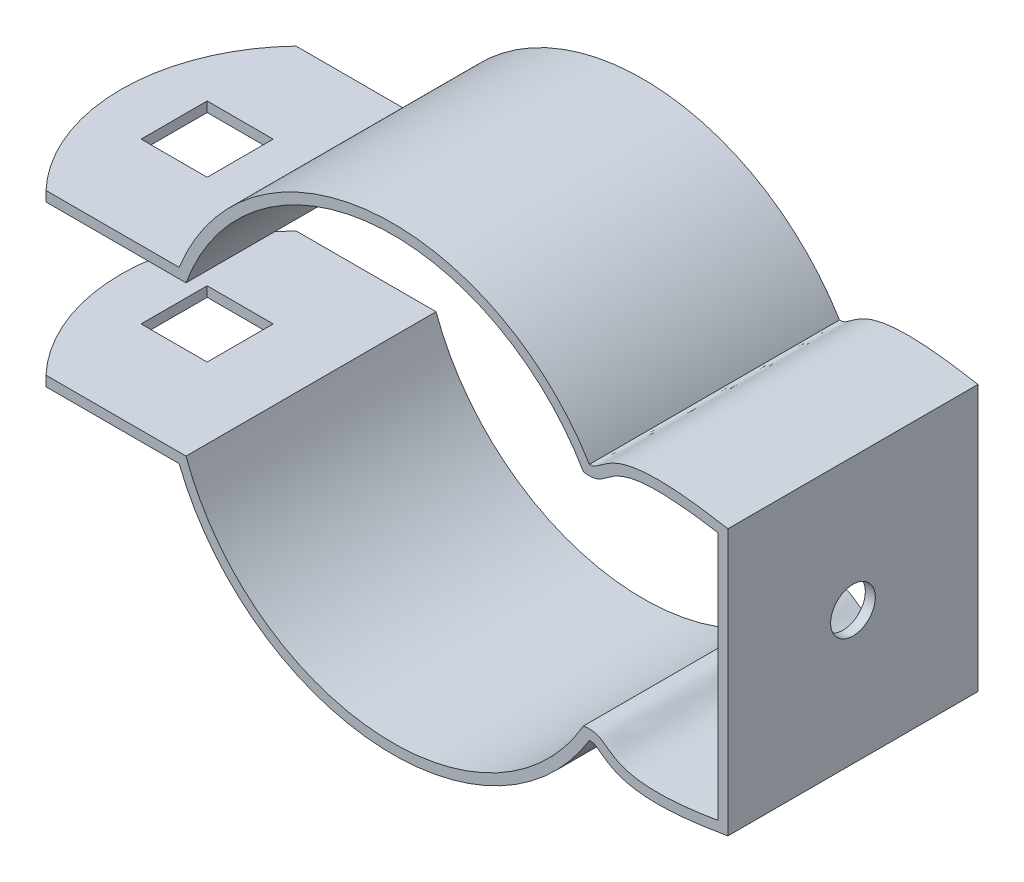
ISO-10303-21;
HEADER;
FILE_DESCRIPTION(('STEP AP214'),'2;1');
FILE_NAME('part.step','',(''),(''),'','','');
FILE_SCHEMA(('AUTOMOTIVE_DESIGN { 1 0 10303 214 1 1 1 1 }'));
ENDSEC;
DATA;
#1=APPLICATION_CONTEXT('core data for automotive mechanical design processes');
#2=APPLICATION_PROTOCOL_DEFINITION('international standard','automotive_design',2000,#1);
#3=PRODUCT_CONTEXT('',#1,'mechanical');
#4=PRODUCT('Part','Part','',(#3));
#5=PRODUCT_RELATED_PRODUCT_CATEGORY('part','',(#4));
#6=PRODUCT_DEFINITION_FORMATION('','',#4);
#7=PRODUCT_DEFINITION_CONTEXT('part definition',#1,'design');
#8=PRODUCT_DEFINITION('design','',#6,#7);
#9=PRODUCT_DEFINITION_SHAPE('','',#8);
#10=(LENGTH_UNIT() NAMED_UNIT(*) SI_UNIT(.MILLI.,.METRE.));
#11=(NAMED_UNIT(*) PLANE_ANGLE_UNIT() SI_UNIT($,.RADIAN.));
#12=(NAMED_UNIT(*) SI_UNIT($,.STERADIAN.) SOLID_ANGLE_UNIT());
#13=UNCERTAINTY_MEASURE_WITH_UNIT(LENGTH_MEASURE(1.E-05),#10,'distance_accuracy_value','');
#14=(GEOMETRIC_REPRESENTATION_CONTEXT(3) GLOBAL_UNCERTAINTY_ASSIGNED_CONTEXT((#13)) GLOBAL_UNIT_ASSIGNED_CONTEXT((#10,
#11,#12)) REPRESENTATION_CONTEXT('',''));
#15=CARTESIAN_POINT('',(0.,0.,0.));
#16=DIRECTION('',(0.,0.,1.));
#17=DIRECTION('',(1.,0.,0.));
#18=AXIS2_PLACEMENT_3D('',#15,#16,#17);
#19=CARTESIAN_POINT('',(-21.5571178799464,17.9950975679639,12.5));
#20=DIRECTION('',(0.,-1.,0.));
#21=DIRECTION('',(0.,0.,-1.));
#22=AXIS2_PLACEMENT_3D('',#19,#20,#21);
#23=CYLINDRICAL_SURFACE('',#22,18.125);
#24=CARTESIAN_POINT('',(-21.5571178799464,7.5,12.5));
#25=DIRECTION('',(0.,1.,0.));
#26=DIRECTION('',(0.,0.,1.));
#27=AXIS2_PLACEMENT_3D('',#24,#25,#26);
#28=CIRCLE('',#27,18.125);
#29=CARTESIAN_POINT('',(-34.6821178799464,7.5,25.));
#30=VERTEX_POINT('',#29);
#31=CARTESIAN_POINT('',(-34.6821178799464,7.49999999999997,0.));
#32=VERTEX_POINT('',#31);
#33=EDGE_CURVE('E267',#30,#32,#28,.F.);
#34=ORIENTED_EDGE('',*,*,#33,.F.);
#35=DIRECTION('',(0.,1.,0.));
#36=VECTOR('',#35,1.);
#37=CARTESIAN_POINT('',(-34.6821178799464,0.,25.));
#38=LINE('',#37,#36);
#39=CARTESIAN_POINT('',(-34.6821178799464,8.5,25.));
#40=VERTEX_POINT('',#39);
#41=EDGE_CURVE('E479',#30,#40,#38,.T.);
#42=ORIENTED_EDGE('',*,*,#41,.T.);
#43=CARTESIAN_POINT('',(-21.5571178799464,8.5,12.5));
#44=DIRECTION('',(0.,-1.,0.));
#45=DIRECTION('',(0.,0.,-1.));
#46=AXIS2_PLACEMENT_3D('',#43,#44,#45);
#47=CIRCLE('',#46,18.125);
#48=CARTESIAN_POINT('',(-34.6821178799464,8.49999999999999,0.));
#49=VERTEX_POINT('',#48);
#50=EDGE_CURVE('E269',#40,#49,#47,.T.);
#51=ORIENTED_EDGE('',*,*,#50,.T.);
#52=DIRECTION('',(0.,1.,0.));
#53=VECTOR('',#52,1.);
#54=CARTESIAN_POINT('',(-34.6821178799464,0.,0.));
#55=LINE('',#54,#53);
#56=EDGE_CURVE('E392',#32,#49,#55,.T.);
#57=ORIENTED_EDGE('',*,*,#56,.F.);
#58=EDGE_LOOP('',(#34,#42,#51,#57));
#59=FACE_BOUND('',#58,.T.);
#60=ADVANCED_FACE('F39',(#59),#23,.T.);
#61=CARTESIAN_POINT('',(33.5,0.,25.));
#62=DIRECTION('',(1.,0.,0.));
#63=DIRECTION('',(0.,0.,-1.));
#64=AXIS2_PLACEMENT_3D('',#61,#62,#63);
#65=PLANE('',#64);
#66=CARTESIAN_POINT('',(33.5,0.,12.5));
#67=DIRECTION('',(1.,0.,0.));
#68=DIRECTION('',(0.,0.,-1.));
#69=AXIS2_PLACEMENT_3D('',#66,#67,#68);
#70=CIRCLE('',#69,2.23393);
#71=CARTESIAN_POINT('',(33.5,0.,10.26607));
#72=VERTEX_POINT('',#71);
#73=EDGE_CURVE('E544',#72,#72,#70,.T.);
#74=ORIENTED_EDGE('',*,*,#73,.F.);
#75=EDGE_LOOP('',(#74));
#76=FACE_BOUND('',#75,.T.);
#77=DIRECTION('',(0.,-1.,0.));
#78=VECTOR('',#77,1.);
#79=CARTESIAN_POINT('',(33.5,0.,0.));
#80=LINE('',#79,#78);
#81=CARTESIAN_POINT('',(33.5,13.2980440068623,0.));
#82=VERTEX_POINT('',#81);
#83=CARTESIAN_POINT('',(33.5,-13.2980440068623,0.));
#84=VERTEX_POINT('',#83);
#85=EDGE_CURVE('E274',#82,#84,#80,.T.);
#86=ORIENTED_EDGE('',*,*,#85,.F.);
#87=DIRECTION('',(0.,0.,-1.));
#88=VECTOR('',#87,1.);
#89=CARTESIAN_POINT('',(33.5,13.2980440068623,25.));
#90=LINE('',#89,#88);
#91=CARTESIAN_POINT('',(33.5,13.2980440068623,25.));
#92=VERTEX_POINT('',#91);
#93=EDGE_CURVE('E11',#92,#82,#90,.T.);
#94=ORIENTED_EDGE('',*,*,#93,.F.);
#95=DIRECTION('',(0.,-1.,0.));
#96=VECTOR('',#95,1.);
#97=CARTESIAN_POINT('',(33.5,0.,25.));
#98=LINE('',#97,#96);
#99=CARTESIAN_POINT('',(33.5,-13.2980440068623,25.));
#100=VERTEX_POINT('',#99);
#101=EDGE_CURVE('E275',#92,#100,#98,.T.);
#102=ORIENTED_EDGE('',*,*,#101,.T.);
#103=DIRECTION('',(0.,0.,-1.));
#104=VECTOR('',#103,1.);
#105=CARTESIAN_POINT('',(33.5,-13.2980440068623,25.));
#106=LINE('',#105,#104);
#107=EDGE_CURVE('E372',#100,#84,#106,.T.);
#108=ORIENTED_EDGE('',*,*,#107,.T.);
#109=EDGE_LOOP('',(#86,#94,#102,#108));
#110=FACE_BOUND('',#109,.T.);
#111=ADVANCED_FACE('F41',(#76,#110),#65,.T.);
#112=CARTESIAN_POINT('',(33.5,13.2980440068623,25.));
#113=CARTESIAN_POINT('',(33.1261043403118,13.3612933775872,25.));
#114=CARTESIAN_POINT('',(32.3695605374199,13.4916630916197,25.));
#115=CARTESIAN_POINT('',(30.9256337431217,13.7163476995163,25.));
#116=CARTESIAN_POINT('',(29.3190618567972,13.9162768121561,25.));
#117=CARTESIAN_POINT('',(27.6553280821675,14.0454168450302,25.));
#118=CARTESIAN_POINT('',(25.7591574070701,14.084635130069,25.));
#119=CARTESIAN_POINT('',(23.9159101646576,13.9155222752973,25.));
#120=CARTESIAN_POINT('',(22.3293240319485,13.4446308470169,25.));
#121=CARTESIAN_POINT('',(21.2309505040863,12.8092823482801,25.));
#122=CARTESIAN_POINT('',(20.6464650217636,12.3460566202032,25.));
#123=CARTESIAN_POINT('',(20.3194048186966,12.125950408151,25.));
#124=CARTESIAN_POINT('',(20.1232766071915,12.0289882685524,25.));
#125=CARTESIAN_POINT('',(19.9476514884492,11.9718309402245,25.));
#126=CARTESIAN_POINT('',(19.7429130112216,11.9521347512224,25.));
#127=CARTESIAN_POINT('',(19.6509426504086,11.9515878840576,25.));
#128=B_SPLINE_CURVE_WITH_KNOTS('',3,(#112,#113,#114,#115,#116,#117,#118,#119,#120,#121,#122,
#123,#124,#125,#126,#127),.UNSPECIFIED.,.F.,.F.,(4,1,1,1,1,1,1,1,1,1,1,1,1,4),
(0.0552082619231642,0.080927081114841,0.106645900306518,0.158083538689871,0.209521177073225,
0.260958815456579,0.363834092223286,0.466709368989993,0.5695846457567,0.672459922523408,
0.723897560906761,0.775335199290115,0.826772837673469,0.878210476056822),.UNSPECIFIED.);
#129=DIRECTION('',(0.,0.,-1.));
#130=VECTOR('',#129,1.);
#131=SURFACE_OF_LINEAR_EXTRUSION('',#128,#130);
#132=CARTESIAN_POINT('',(33.5,13.2980440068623,0.));
#133=CARTESIAN_POINT('',(33.1261043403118,13.3612933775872,0.));
#134=CARTESIAN_POINT('',(32.3695605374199,13.4916630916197,0.));
#135=CARTESIAN_POINT('',(30.9256337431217,13.7163476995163,0.));
#136=CARTESIAN_POINT('',(29.3190618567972,13.9162768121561,0.));
#137=CARTESIAN_POINT('',(27.6553280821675,14.0454168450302,0.));
#138=CARTESIAN_POINT('',(25.7591574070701,14.084635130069,0.));
#139=CARTESIAN_POINT('',(23.9159101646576,13.9155222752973,0.));
#140=CARTESIAN_POINT('',(22.3293240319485,13.4446308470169,0.));
#141=CARTESIAN_POINT('',(21.2309505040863,12.8092823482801,0.));
#142=CARTESIAN_POINT('',(20.6464650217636,12.3460566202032,0.));
#143=CARTESIAN_POINT('',(20.3194048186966,12.125950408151,0.));
#144=CARTESIAN_POINT('',(20.1232766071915,12.0289882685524,0.));
#145=CARTESIAN_POINT('',(19.9476514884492,11.9718309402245,0.));
#146=CARTESIAN_POINT('',(19.7429130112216,11.9521347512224,0.));
#147=CARTESIAN_POINT('',(19.6509426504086,11.9515878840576,0.));
#148=B_SPLINE_CURVE_WITH_KNOTS('',3,(#132,#133,#134,#135,#136,#137,#138,#139,#140,#141,#142,
#143,#144,#145,#146,#147),.UNSPECIFIED.,.F.,.F.,(4,1,1,1,1,1,1,1,1,1,1,1,1,4),
(0.0552082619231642,0.080927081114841,0.106645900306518,0.158083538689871,0.209521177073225,
0.260958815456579,0.363834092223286,0.466709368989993,0.5695846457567,0.672459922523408,
0.723897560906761,0.775335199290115,0.826772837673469,0.878210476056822),.UNSPECIFIED.);
#149=CARTESIAN_POINT('',(19.6509426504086,11.9515878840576,0.));
#150=VERTEX_POINT('',#149);
#151=EDGE_CURVE('E380',#82,#150,#148,.T.);
#152=ORIENTED_EDGE('',*,*,#151,.T.);
#153=DIRECTION('',(0.,0.,-1.));
#154=VECTOR('',#153,1.);
#155=CARTESIAN_POINT('',(19.6509426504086,11.9515878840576,25.));
#156=LINE('',#155,#154);
#157=CARTESIAN_POINT('',(19.6509426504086,11.9515878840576,25.));
#158=VERTEX_POINT('',#157);
#159=EDGE_CURVE('E48',#158,#150,#156,.T.);
#160=ORIENTED_EDGE('',*,*,#159,.F.);
#161=EDGE_CURVE('E278',#92,#158,#128,.T.);
#162=ORIENTED_EDGE('',*,*,#161,.F.);
#163=ORIENTED_EDGE('',*,*,#93,.T.);
#164=EDGE_LOOP('',(#152,#160,#162,#163));
#165=FACE_BOUND('',#164,.T.);
#166=ADVANCED_FACE('F289',(#165),#131,.F.);
#167=CARTESIAN_POINT('',(0.,0.,25.));
#168=DIRECTION('',(0.,0.,-1.));
#169=DIRECTION('',(-1.,0.,0.));
#170=AXIS2_PLACEMENT_3D('',#167,#168,#169);
#171=CYLINDRICAL_SURFACE('',#170,23.);
#172=CARTESIAN_POINT('',(0.,0.,0.));
#173=DIRECTION('',(0.,0.,1.));
#174=DIRECTION('',(1.,0.,0.));
#175=AXIS2_PLACEMENT_3D('',#172,#173,#174);
#176=CIRCLE('',#175,23.);
#177=CARTESIAN_POINT('',(-21.3717102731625,8.49999999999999,0.));
#178=VERTEX_POINT('',#177);
#179=EDGE_CURVE('E384',#150,#178,#176,.T.);
#180=ORIENTED_EDGE('',*,*,#179,.T.);
#181=DIRECTION('',(0.,0.,-1.));
#182=VECTOR('',#181,1.);
#183=CARTESIAN_POINT('',(-21.3717102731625,8.49999999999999,25.));
#184=LINE('',#183,#182);
#185=CARTESIAN_POINT('',(-21.3717102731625,8.49999999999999,25.));
#186=VERTEX_POINT('',#185);
#187=EDGE_CURVE('E458',#186,#178,#184,.T.);
#188=ORIENTED_EDGE('',*,*,#187,.F.);
#189=CARTESIAN_POINT('',(0.,0.,25.));
#190=DIRECTION('',(0.,0.,1.));
#191=DIRECTION('',(1.,0.,0.));
#192=AXIS2_PLACEMENT_3D('',#189,#190,#191);
#193=CIRCLE('',#192,23.);
#194=EDGE_CURVE('E284',#158,#186,#193,.T.);
#195=ORIENTED_EDGE('',*,*,#194,.F.);
#196=ORIENTED_EDGE('',*,*,#159,.T.);
#197=EDGE_LOOP('',(#180,#188,#195,#196));
#198=FACE_BOUND('',#197,.T.);
#199=ADVANCED_FACE('F292',(#198),#171,.T.);
#200=CARTESIAN_POINT('',(0.,8.49999999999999,25.));
#201=DIRECTION('',(0.,-1.,0.));
#202=DIRECTION('',(0.,0.,-1.));
#203=AXIS2_PLACEMENT_3D('',#200,#201,#202);
#204=PLANE('',#203);
#205=DIRECTION('',(-1.,0.,0.));
#206=VECTOR('',#205,1.);
#207=CARTESIAN_POINT('',(0.,8.49999999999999,15.802));
#208=LINE('',#207,#206);
#209=CARTESIAN_POINT('',(-27.7677102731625,8.49999999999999,15.802));
#210=VERTEX_POINT('',#209);
#211=CARTESIAN_POINT('',(-34.3717102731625,8.49999999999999,15.802));
#212=VERTEX_POINT('',#211);
#213=EDGE_CURVE('E254',#210,#212,#208,.T.);
#214=ORIENTED_EDGE('',*,*,#213,.T.);
#215=DIRECTION('',(0.,0.,-1.));
#216=VECTOR('',#215,1.);
#217=CARTESIAN_POINT('',(-34.3717102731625,8.49999999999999,25.));
#218=LINE('',#217,#216);
#219=CARTESIAN_POINT('',(-34.3717102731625,8.49999999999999,9.198));
#220=VERTEX_POINT('',#219);
#221=EDGE_CURVE('E262',#212,#220,#218,.T.);
#222=ORIENTED_EDGE('',*,*,#221,.T.);
#223=DIRECTION('',(1.,0.,0.));
#224=VECTOR('',#223,1.);
#225=CARTESIAN_POINT('',(0.,8.49999999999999,9.198));
#226=LINE('',#225,#224);
#227=CARTESIAN_POINT('',(-27.7677102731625,8.49999999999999,9.198));
#228=VERTEX_POINT('',#227);
#229=EDGE_CURVE('E240',#220,#228,#226,.T.);
#230=ORIENTED_EDGE('',*,*,#229,.T.);
#231=DIRECTION('',(0.,0.,1.));
#232=VECTOR('',#231,1.);
#233=CARTESIAN_POINT('',(-27.7677102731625,8.49999999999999,25.));
#234=LINE('',#233,#232);
#235=EDGE_CURVE('E246',#228,#210,#234,.T.);
#236=ORIENTED_EDGE('',*,*,#235,.T.);
#237=EDGE_LOOP('',(#214,#222,#230,#236));
#238=FACE_BOUND('',#237,.T.);
#239=DIRECTION('',(-1.,0.,0.));
#240=VECTOR('',#239,1.);
#241=CARTESIAN_POINT('',(0.,8.49999999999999,0.));
#242=LINE('',#241,#240);
#243=EDGE_CURVE('E389',#178,#49,#242,.T.);
#244=ORIENTED_EDGE('',*,*,#243,.T.);
#245=ORIENTED_EDGE('',*,*,#50,.F.);
#246=DIRECTION('',(-1.,0.,0.));
#247=VECTOR('',#246,1.);
#248=CARTESIAN_POINT('',(0.,8.49999999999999,25.));
#249=LINE('',#248,#247);
#250=EDGE_CURVE('E476',#186,#40,#249,.T.);
#251=ORIENTED_EDGE('',*,*,#250,.F.);
#252=ORIENTED_EDGE('',*,*,#187,.T.);
#253=EDGE_LOOP('',(#244,#245,#251,#252));
#254=FACE_BOUND('',#253,.T.);
#255=ADVANCED_FACE('F296',(#238,#254),#204,.F.);
#256=CARTESIAN_POINT('',(0.,7.5,25.));
#257=DIRECTION('',(0.,-1.,0.));
#258=DIRECTION('',(1.,0.,0.));
#259=AXIS2_PLACEMENT_3D('',#256,#257,#258);
#260=PLANE('',#259);
#261=DIRECTION('',(0.,0.,-1.));
#262=VECTOR('',#261,1.);
#263=CARTESIAN_POINT('',(-34.3717102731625,7.5,25.));
#264=LINE('',#263,#262);
#265=CARTESIAN_POINT('',(-34.3717102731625,7.5,15.802));
#266=VERTEX_POINT('',#265);
#267=CARTESIAN_POINT('',(-34.3717102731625,7.5,9.198));
#268=VERTEX_POINT('',#267);
#269=EDGE_CURVE('E260',#266,#268,#264,.T.);
#270=ORIENTED_EDGE('',*,*,#269,.F.);
#271=DIRECTION('',(-1.,0.,0.));
#272=VECTOR('',#271,1.);
#273=CARTESIAN_POINT('',(0.,7.5,15.802));
#274=LINE('',#273,#272);
#275=CARTESIAN_POINT('',(-27.7677102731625,7.5,15.802));
#276=VERTEX_POINT('',#275);
#277=EDGE_CURVE('E252',#276,#266,#274,.T.);
#278=ORIENTED_EDGE('',*,*,#277,.F.);
#279=DIRECTION('',(0.,0.,1.));
#280=VECTOR('',#279,1.);
#281=CARTESIAN_POINT('',(-27.7677102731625,7.5,25.));
#282=LINE('',#281,#280);
#283=CARTESIAN_POINT('',(-27.7677102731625,7.5,9.198));
#284=VERTEX_POINT('',#283);
#285=EDGE_CURVE('E244',#284,#276,#282,.T.);
#286=ORIENTED_EDGE('',*,*,#285,.F.);
#287=DIRECTION('',(1.,0.,0.));
#288=VECTOR('',#287,1.);
#289=CARTESIAN_POINT('',(0.,7.5,9.198));
#290=LINE('',#289,#288);
#291=EDGE_CURVE('E238',#268,#284,#290,.T.);
#292=ORIENTED_EDGE('',*,*,#291,.F.);
#293=EDGE_LOOP('',(#270,#278,#286,#292));
#294=FACE_BOUND('',#293,.T.);
#295=DIRECTION('',(-1.,0.,0.));
#296=VECTOR('',#295,1.);
#297=CARTESIAN_POINT('',(0.,7.5,0.));
#298=LINE('',#297,#296);
#299=CARTESIAN_POINT('',(-20.6821178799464,7.5,0.));
#300=VERTEX_POINT('',#299);
#301=EDGE_CURVE('E395',#300,#32,#298,.T.);
#302=ORIENTED_EDGE('',*,*,#301,.F.);
#303=DIRECTION('',(0.,0.,-1.));
#304=VECTOR('',#303,1.);
#305=CARTESIAN_POINT('',(-20.6821178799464,7.5,25.));
#306=LINE('',#305,#304);
#307=CARTESIAN_POINT('',(-20.6821178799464,7.5,25.));
#308=VERTEX_POINT('',#307);
#309=EDGE_CURVE('E456',#308,#300,#306,.T.);
#310=ORIENTED_EDGE('',*,*,#309,.F.);
#311=DIRECTION('',(-1.,0.,0.));
#312=VECTOR('',#311,1.);
#313=CARTESIAN_POINT('',(0.,7.5,25.));
#314=LINE('',#313,#312);
#315=EDGE_CURVE('E480',#308,#30,#314,.T.);
#316=ORIENTED_EDGE('',*,*,#315,.T.);
#317=ORIENTED_EDGE('',*,*,#33,.T.);
#318=EDGE_LOOP('',(#302,#310,#316,#317));
#319=FACE_BOUND('',#318,.T.);
#320=ADVANCED_FACE('F300',(#294,#319),#260,.T.);
#321=CARTESIAN_POINT('',(0.,0.,25.));
#322=DIRECTION('',(0.,0.,-1.));
#323=DIRECTION('',(-1.,0.,0.));
#324=AXIS2_PLACEMENT_3D('',#321,#322,#323);
#325=CYLINDRICAL_SURFACE('',#324,22.);
#326=CARTESIAN_POINT('',(0.,0.,0.));
#327=DIRECTION('',(0.,0.,1.));
#328=DIRECTION('',(1.,0.,0.));
#329=AXIS2_PLACEMENT_3D('',#326,#327,#328);
#330=CIRCLE('',#329,22.);
#331=CARTESIAN_POINT('',(19.0525588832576,11.,0.));
#332=VERTEX_POINT('',#331);
#333=EDGE_CURVE('E398',#332,#300,#330,.T.);
#334=ORIENTED_EDGE('',*,*,#333,.F.);
#335=DIRECTION('',(0.,0.,-1.));
#336=VECTOR('',#335,1.);
#337=CARTESIAN_POINT('',(19.0525588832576,11.,25.));
#338=LINE('',#337,#336);
#339=CARTESIAN_POINT('',(19.0525588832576,11.,25.));
#340=VERTEX_POINT('',#339);
#341=EDGE_CURVE('E454',#340,#332,#338,.T.);
#342=ORIENTED_EDGE('',*,*,#341,.F.);
#343=CARTESIAN_POINT('',(0.,0.,25.));
#344=DIRECTION('',(0.,0.,1.));
#345=DIRECTION('',(1.,0.,0.));
#346=AXIS2_PLACEMENT_3D('',#343,#344,#345);
#347=CIRCLE('',#346,22.);
#348=EDGE_CURVE('E323',#340,#308,#347,.T.);
#349=ORIENTED_EDGE('',*,*,#348,.T.);
#350=ORIENTED_EDGE('',*,*,#309,.T.);
#351=EDGE_LOOP('',(#334,#342,#349,#350));
#352=FACE_BOUND('',#351,.T.);
#353=ADVANCED_FACE('F304',(#352),#325,.F.);
#354=CARTESIAN_POINT('',(19.0525588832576,11.,25.));
#355=CARTESIAN_POINT('',(22.5442841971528,10.4663623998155,25.));
#356=CARTESIAN_POINT('',(20.0291097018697,14.5626151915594,25.));
#357=CARTESIAN_POINT('',(32.5,12.453,25.));
#358=B_SPLINE_CURVE_WITH_KNOTS('',3,(#354,#355,#356,#357),.UNSPECIFIED.,.F.,.F.,(4,4),(0.,
0.859078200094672),.UNSPECIFIED.);
#359=DIRECTION('',(0.,0.,-1.));
#360=VECTOR('',#359,1.);
#361=SURFACE_OF_LINEAR_EXTRUSION('',#358,#360);
#362=CARTESIAN_POINT('',(19.0525588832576,11.,0.));
#363=CARTESIAN_POINT('',(22.5442841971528,10.4663623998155,0.));
#364=CARTESIAN_POINT('',(20.0291097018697,14.5626151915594,0.));
#365=CARTESIAN_POINT('',(32.5,12.453,0.));
#366=B_SPLINE_CURVE_WITH_KNOTS('',3,(#362,#363,#364,#365),.UNSPECIFIED.,.F.,.F.,(4,4),(0.,
0.859078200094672),.UNSPECIFIED.);
#367=CARTESIAN_POINT('',(32.5,12.453,0.));
#368=VERTEX_POINT('',#367);
#369=EDGE_CURVE('E401',#332,#368,#366,.T.);
#370=ORIENTED_EDGE('',*,*,#369,.T.);
#371=DIRECTION('',(0.,0.,-1.));
#372=VECTOR('',#371,1.);
#373=CARTESIAN_POINT('',(32.5,12.453,25.));
#374=LINE('',#373,#372);
#375=CARTESIAN_POINT('',(32.5,12.453,25.));
#376=VERTEX_POINT('',#375);
#377=EDGE_CURVE('E451',#376,#368,#374,.T.);
#378=ORIENTED_EDGE('',*,*,#377,.F.);
#379=EDGE_CURVE('E316',#340,#376,#358,.T.);
#380=ORIENTED_EDGE('',*,*,#379,.F.);
#381=ORIENTED_EDGE('',*,*,#341,.T.);
#382=EDGE_LOOP('',(#370,#378,#380,#381));
#383=FACE_BOUND('',#382,.T.);
#384=ADVANCED_FACE('F308',(#383),#361,.F.);
#385=CARTESIAN_POINT('',(32.5,0.,25.));
#386=DIRECTION('',(1.,0.,0.));
#387=DIRECTION('',(0.,1.,0.));
#388=AXIS2_PLACEMENT_3D('',#385,#386,#387);
#389=PLANE('',#388);
#390=CARTESIAN_POINT('',(32.5,0.,12.5));
#391=DIRECTION('',(1.,0.,0.));
#392=DIRECTION('',(0.,1.,0.));
#393=AXIS2_PLACEMENT_3D('',#390,#391,#392);
#394=CIRCLE('',#393,2.23393);
#395=CARTESIAN_POINT('',(32.5,2.23393,12.5));
#396=VERTEX_POINT('',#395);
#397=EDGE_CURVE('E43',#396,#396,#394,.T.);
#398=ORIENTED_EDGE('',*,*,#397,.T.);
#399=EDGE_LOOP('',(#398));
#400=FACE_BOUND('',#399,.T.);
#401=DIRECTION('',(0.,-1.,0.));
#402=VECTOR('',#401,1.);
#403=CARTESIAN_POINT('',(32.5,0.,0.));
#404=LINE('',#403,#402);
#405=CARTESIAN_POINT('',(32.5,-12.453,0.));
#406=VERTEX_POINT('',#405);
#407=EDGE_CURVE('E405',#368,#406,#404,.T.);
#408=ORIENTED_EDGE('',*,*,#407,.T.);
#409=DIRECTION('',(0.,0.,-1.));
#410=VECTOR('',#409,1.);
#411=CARTESIAN_POINT('',(32.5,-12.453,25.));
#412=LINE('',#411,#410);
#413=CARTESIAN_POINT('',(32.5,-12.453,25.));
#414=VERTEX_POINT('',#413);
#415=EDGE_CURVE('E449',#414,#406,#412,.T.);
#416=ORIENTED_EDGE('',*,*,#415,.F.);
#417=DIRECTION('',(0.,-1.,0.));
#418=VECTOR('',#417,1.);
#419=CARTESIAN_POINT('',(32.5,0.,25.));
#420=LINE('',#419,#418);
#421=EDGE_CURVE('E322',#376,#414,#420,.T.);
#422=ORIENTED_EDGE('',*,*,#421,.F.);
#423=ORIENTED_EDGE('',*,*,#377,.T.);
#424=EDGE_LOOP('',(#408,#416,#422,#423));
#425=FACE_BOUND('',#424,.T.);
#426=ADVANCED_FACE('F313',(#400,#425),#389,.F.);
#427=CARTESIAN_POINT('',(19.0525588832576,-11.,25.));
#428=CARTESIAN_POINT('',(22.5442841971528,-10.4663623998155,25.));
#429=CARTESIAN_POINT('',(20.0291097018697,-14.5626151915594,25.));
#430=CARTESIAN_POINT('',(32.5,-12.453,25.));
#431=B_SPLINE_CURVE_WITH_KNOTS('',3,(#427,#428,#429,#430),.UNSPECIFIED.,.F.,.F.,(4,4),(0.,
0.859078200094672),.UNSPECIFIED.);
#432=DIRECTION('',(0.,0.,-1.));
#433=VECTOR('',#432,1.);
#434=SURFACE_OF_LINEAR_EXTRUSION('',#431,#433);
#435=CARTESIAN_POINT('',(19.0525588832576,-11.,0.));
#436=CARTESIAN_POINT('',(22.5442841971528,-10.4663623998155,0.));
#437=CARTESIAN_POINT('',(20.0291097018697,-14.5626151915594,0.));
#438=CARTESIAN_POINT('',(32.5,-12.453,0.));
#439=B_SPLINE_CURVE_WITH_KNOTS('',3,(#435,#436,#437,#438),.UNSPECIFIED.,.F.,.F.,(4,4),(0.,
0.859078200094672),.UNSPECIFIED.);
#440=CARTESIAN_POINT('',(19.0525588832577,-11.,0.));
#441=VERTEX_POINT('',#440);
#442=EDGE_CURVE('E411',#441,#406,#439,.T.);
#443=ORIENTED_EDGE('',*,*,#442,.F.);
#444=DIRECTION('',(0.,0.,-1.));
#445=VECTOR('',#444,1.);
#446=CARTESIAN_POINT('',(19.0525588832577,-11.,25.));
#447=LINE('',#446,#445);
#448=CARTESIAN_POINT('',(19.0525588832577,-11.,25.));
#449=VERTEX_POINT('',#448);
#450=EDGE_CURVE('E447',#449,#441,#447,.T.);
#451=ORIENTED_EDGE('',*,*,#450,.F.);
#452=EDGE_CURVE('E329',#449,#414,#431,.T.);
#453=ORIENTED_EDGE('',*,*,#452,.T.);
#454=ORIENTED_EDGE('',*,*,#415,.T.);
#455=EDGE_LOOP('',(#443,#451,#453,#454));
#456=FACE_BOUND('',#455,.T.);
#457=ADVANCED_FACE('F340',(#456),#434,.T.);
#458=CARTESIAN_POINT('',(0.,0.,25.));
#459=DIRECTION('',(0.,0.,-1.));
#460=DIRECTION('',(-1.,0.,0.));
#461=AXIS2_PLACEMENT_3D('',#458,#459,#460);
#462=CYLINDRICAL_SURFACE('',#461,22.);
#463=CARTESIAN_POINT('',(0.,0.,0.));
#464=DIRECTION('',(0.,0.,1.));
#465=DIRECTION('',(1.,0.,0.));
#466=AXIS2_PLACEMENT_3D('',#463,#464,#465);
#467=CIRCLE('',#466,22.);
#468=CARTESIAN_POINT('',(-20.6821178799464,-7.5,0.));
#469=VERTEX_POINT('',#468);
#470=EDGE_CURVE('E416',#469,#441,#467,.T.);
#471=ORIENTED_EDGE('',*,*,#470,.F.);
#472=DIRECTION('',(0.,0.,-1.));
#473=VECTOR('',#472,1.);
#474=CARTESIAN_POINT('',(-20.6821178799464,-7.5,25.));
#475=LINE('',#474,#473);
#476=CARTESIAN_POINT('',(-20.6821178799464,-7.5,25.));
#477=VERTEX_POINT('',#476);
#478=EDGE_CURVE('E445',#477,#469,#475,.T.);
#479=ORIENTED_EDGE('',*,*,#478,.F.);
#480=CARTESIAN_POINT('',(0.,0.,25.));
#481=DIRECTION('',(0.,0.,1.));
#482=DIRECTION('',(1.,0.,0.));
#483=AXIS2_PLACEMENT_3D('',#480,#481,#482);
#484=CIRCLE('',#483,22.);
#485=EDGE_CURVE('E335',#477,#449,#484,.T.);
#486=ORIENTED_EDGE('',*,*,#485,.T.);
#487=ORIENTED_EDGE('',*,*,#450,.T.);
#488=EDGE_LOOP('',(#471,#479,#486,#487));
#489=FACE_BOUND('',#488,.T.);
#490=ADVANCED_FACE('F343',(#489),#462,.F.);
#491=CARTESIAN_POINT('',(0.,-7.5,25.));
#492=DIRECTION('',(0.,-1.,0.));
#493=DIRECTION('',(1.,0.,0.));
#494=AXIS2_PLACEMENT_3D('',#491,#492,#493);
#495=PLANE('',#494);
#496=DIRECTION('',(-1.,0.,0.));
#497=VECTOR('',#496,1.);
#498=CARTESIAN_POINT('',(0.,-7.5,15.802));
#499=LINE('',#498,#497);
#500=CARTESIAN_POINT('',(-27.7677102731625,-7.5,15.802));
#501=VERTEX_POINT('',#500);
#502=CARTESIAN_POINT('',(-34.3717102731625,-7.5,15.802));
#503=VERTEX_POINT('',#502);
#504=EDGE_CURVE('E249',#501,#503,#499,.T.);
#505=ORIENTED_EDGE('',*,*,#504,.T.);
#506=DIRECTION('',(0.,0.,-1.));
#507=VECTOR('',#506,1.);
#508=CARTESIAN_POINT('',(-34.3717102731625,-7.5,25.));
#509=LINE('',#508,#507);
#510=CARTESIAN_POINT('',(-34.3717102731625,-7.5,9.198));
#511=VERTEX_POINT('',#510);
#512=EDGE_CURVE('E257',#503,#511,#509,.T.);
#513=ORIENTED_EDGE('',*,*,#512,.T.);
#514=DIRECTION('',(1.,0.,0.));
#515=VECTOR('',#514,1.);
#516=CARTESIAN_POINT('',(0.,-7.5,9.198));
#517=LINE('',#516,#515);
#518=CARTESIAN_POINT('',(-27.7677102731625,-7.5,9.198));
#519=VERTEX_POINT('',#518);
#520=EDGE_CURVE('E236',#511,#519,#517,.T.);
#521=ORIENTED_EDGE('',*,*,#520,.T.);
#522=DIRECTION('',(0.,0.,1.));
#523=VECTOR('',#522,1.);
#524=CARTESIAN_POINT('',(-27.7677102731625,-7.5,25.));
#525=LINE('',#524,#523);
#526=EDGE_CURVE('E207',#519,#501,#525,.T.);
#527=ORIENTED_EDGE('',*,*,#526,.T.);
#528=EDGE_LOOP('',(#505,#513,#521,#527));
#529=FACE_BOUND('',#528,.T.);
#530=DIRECTION('',(-1.,0.,0.));
#531=VECTOR('',#530,1.);
#532=CARTESIAN_POINT('',(0.,-7.5,0.));
#533=LINE('',#532,#531);
#534=CARTESIAN_POINT('',(-34.6821178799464,-7.5,0.));
#535=VERTEX_POINT('',#534);
#536=EDGE_CURVE('E422',#469,#535,#533,.T.);
#537=ORIENTED_EDGE('',*,*,#536,.T.);
#538=CARTESIAN_POINT('',(-21.5571178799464,-7.5,12.5));
#539=DIRECTION('',(0.,-1.,0.));
#540=DIRECTION('',(0.,0.,-1.));
#541=AXIS2_PLACEMENT_3D('',#538,#539,#540);
#542=CIRCLE('',#541,18.125);
#543=CARTESIAN_POINT('',(-34.6821178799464,-7.5,25.));
#544=VERTEX_POINT('',#543);
#545=EDGE_CURVE('E265',#535,#544,#542,.F.);
#546=ORIENTED_EDGE('',*,*,#545,.T.);
#547=DIRECTION('',(-1.,0.,0.));
#548=VECTOR('',#547,1.);
#549=CARTESIAN_POINT('',(0.,-7.5,25.));
#550=LINE('',#549,#548);
#551=EDGE_CURVE('E505',#477,#544,#550,.T.);
#552=ORIENTED_EDGE('',*,*,#551,.F.);
#553=ORIENTED_EDGE('',*,*,#478,.T.);
#554=EDGE_LOOP('',(#537,#546,#552,#553));
#555=FACE_BOUND('',#554,.T.);
#556=ADVANCED_FACE('F347',(#529,#555),#495,.F.);
#557=CARTESIAN_POINT('',(0.,-8.5,25.));
#558=DIRECTION('',(0.,-1.,0.));
#559=DIRECTION('',(0.,0.,-1.));
#560=AXIS2_PLACEMENT_3D('',#557,#558,#559);
#561=PLANE('',#560);
#562=DIRECTION('',(0.,0.,-1.));
#563=VECTOR('',#562,1.);
#564=CARTESIAN_POINT('',(-34.3717102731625,-8.5,15.802));
#565=LINE('',#564,#563);
#566=CARTESIAN_POINT('',(-34.3717102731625,-8.5,15.802));
#567=VERTEX_POINT('',#566);
#568=CARTESIAN_POINT('',(-34.3717102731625,-8.5,9.198));
#569=VERTEX_POINT('',#568);
#570=EDGE_CURVE('E219',#567,#569,#565,.T.);
#571=ORIENTED_EDGE('',*,*,#570,.F.);
#572=DIRECTION('',(-1.,0.,0.));
#573=VECTOR('',#572,1.);
#574=CARTESIAN_POINT('',(-34.3717102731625,-8.5,15.802));
#575=LINE('',#574,#573);
#576=CARTESIAN_POINT('',(-27.7677102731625,-8.5,15.802));
#577=VERTEX_POINT('',#576);
#578=EDGE_CURVE('E224',#577,#567,#575,.T.);
#579=ORIENTED_EDGE('',*,*,#578,.F.);
#580=DIRECTION('',(0.,0.,1.));
#581=VECTOR('',#580,1.);
#582=CARTESIAN_POINT('',(-27.7677102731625,-8.5,15.802));
#583=LINE('',#582,#581);
#584=CARTESIAN_POINT('',(-27.7677102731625,-8.5,9.198));
#585=VERTEX_POINT('',#584);
#586=EDGE_CURVE('E204',#585,#577,#583,.T.);
#587=ORIENTED_EDGE('',*,*,#586,.F.);
#588=DIRECTION('',(1.,0.,0.));
#589=VECTOR('',#588,1.);
#590=CARTESIAN_POINT('',(-34.3717102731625,-8.5,9.198));
#591=LINE('',#590,#589);
#592=EDGE_CURVE('E213',#569,#585,#591,.T.);
#593=ORIENTED_EDGE('',*,*,#592,.F.);
#594=EDGE_LOOP('',(#571,#579,#587,#593));
#595=FACE_BOUND('',#594,.T.);
#596=DIRECTION('',(-1.,0.,0.));
#597=VECTOR('',#596,1.);
#598=CARTESIAN_POINT('',(0.,-8.5,0.));
#599=LINE('',#598,#597);
#600=CARTESIAN_POINT('',(-21.3717102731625,-8.5,0.));
#601=VERTEX_POINT('',#600);
#602=CARTESIAN_POINT('',(-34.6821178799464,-8.5,0.));
#603=VERTEX_POINT('',#602);
#604=EDGE_CURVE('E428',#601,#603,#599,.T.);
#605=ORIENTED_EDGE('',*,*,#604,.F.);
#606=DIRECTION('',(0.,0.,-1.));
#607=VECTOR('',#606,1.);
#608=CARTESIAN_POINT('',(-21.3717102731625,-8.5,25.));
#609=LINE('',#608,#607);
#610=CARTESIAN_POINT('',(-21.3717102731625,-8.5,25.));
#611=VERTEX_POINT('',#610);
#612=EDGE_CURVE('E443',#611,#601,#609,.T.);
#613=ORIENTED_EDGE('',*,*,#612,.F.);
#614=DIRECTION('',(-1.,0.,0.));
#615=VECTOR('',#614,1.);
#616=CARTESIAN_POINT('',(0.,-8.5,25.));
#617=LINE('',#616,#615);
#618=CARTESIAN_POINT('',(-34.6821178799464,-8.5,25.));
#619=VERTEX_POINT('',#618);
#620=EDGE_CURVE('E507',#611,#619,#617,.T.);
#621=ORIENTED_EDGE('',*,*,#620,.T.);
#622=CARTESIAN_POINT('',(-21.5571178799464,-8.5,12.5));
#623=DIRECTION('',(0.,-1.,0.));
#624=DIRECTION('',(0.,0.,-1.));
#625=AXIS2_PLACEMENT_3D('',#622,#623,#624);
#626=CIRCLE('',#625,18.125);
#627=EDGE_CURVE('E271',#619,#603,#626,.T.);
#628=ORIENTED_EDGE('',*,*,#627,.T.);
#629=EDGE_LOOP('',(#605,#613,#621,#628));
#630=FACE_BOUND('',#629,.T.);
#631=ADVANCED_FACE('F221',(#595,#630),#561,.T.);
#632=CARTESIAN_POINT('',(0.,0.,25.));
#633=DIRECTION('',(0.,0.,-1.));
#634=DIRECTION('',(-1.,0.,0.));
#635=AXIS2_PLACEMENT_3D('',#632,#633,#634);
#636=CYLINDRICAL_SURFACE('',#635,23.);
#637=CARTESIAN_POINT('',(0.,0.,0.));
#638=DIRECTION('',(0.,0.,1.));
#639=DIRECTION('',(1.,0.,0.));
#640=AXIS2_PLACEMENT_3D('',#637,#638,#639);
#641=CIRCLE('',#640,23.);
#642=CARTESIAN_POINT('',(19.6509426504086,-11.9515878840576,0.));
#643=VERTEX_POINT('',#642);
#644=EDGE_CURVE('E430',#601,#643,#641,.T.);
#645=ORIENTED_EDGE('',*,*,#644,.T.);
#646=DIRECTION('',(0.,0.,-1.));
#647=VECTOR('',#646,1.);
#648=CARTESIAN_POINT('',(19.6509426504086,-11.9515878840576,25.));
#649=LINE('',#648,#647);
#650=CARTESIAN_POINT('',(19.6509426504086,-11.9515878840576,25.));
#651=VERTEX_POINT('',#650);
#652=EDGE_CURVE('E440',#651,#643,#649,.T.);
#653=ORIENTED_EDGE('',*,*,#652,.F.);
#654=CARTESIAN_POINT('',(0.,0.,25.));
#655=DIRECTION('',(0.,0.,1.));
#656=DIRECTION('',(1.,0.,0.));
#657=AXIS2_PLACEMENT_3D('',#654,#655,#656);
#658=CIRCLE('',#657,23.);
#659=EDGE_CURVE('E373',#611,#651,#658,.T.);
#660=ORIENTED_EDGE('',*,*,#659,.F.);
#661=ORIENTED_EDGE('',*,*,#612,.T.);
#662=EDGE_LOOP('',(#645,#653,#660,#661));
#663=FACE_BOUND('',#662,.T.);
#664=ADVANCED_FACE('F354',(#663),#636,.T.);
#665=CARTESIAN_POINT('',(19.6509426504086,-11.9515878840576,25.));
#666=CARTESIAN_POINT('',(19.7429130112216,-11.9521347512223,25.));
#667=CARTESIAN_POINT('',(19.9476514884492,-11.9718309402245,25.));
#668=CARTESIAN_POINT('',(20.1232766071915,-12.0289882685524,25.));
#669=CARTESIAN_POINT('',(20.3194048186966,-12.125950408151,25.));
#670=CARTESIAN_POINT('',(20.6464650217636,-12.3460566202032,25.));
#671=CARTESIAN_POINT('',(21.2309505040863,-12.8092823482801,25.));
#672=CARTESIAN_POINT('',(22.3293240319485,-13.4446308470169,25.));
#673=CARTESIAN_POINT('',(23.9159101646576,-13.9155222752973,25.));
#674=CARTESIAN_POINT('',(25.7591574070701,-14.084635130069,25.));
#675=CARTESIAN_POINT('',(27.6553280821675,-14.0454168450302,25.));
#676=CARTESIAN_POINT('',(29.3190618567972,-13.9162768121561,25.));
#677=CARTESIAN_POINT('',(30.9256337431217,-13.7163476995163,25.));
#678=CARTESIAN_POINT('',(32.3695605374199,-13.4916630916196,25.));
#679=CARTESIAN_POINT('',(33.1261043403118,-13.3612933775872,25.));
#680=CARTESIAN_POINT('',(33.5,-13.2980440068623,25.));
#681=B_SPLINE_CURVE_WITH_KNOTS('',3,(#665,#666,#667,#668,#669,#670,#671,#672,#673,#674,#675,
#676,#677,#678,#679,#680),.UNSPECIFIED.,.F.,.F.,(4,1,1,1,1,1,1,1,1,1,1,1,1,4),
(0.0552082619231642,0.106645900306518,0.158083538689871,0.209521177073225,0.260958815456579,
0.363834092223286,0.466709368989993,0.5695846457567,0.672459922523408,0.723897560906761,
0.775335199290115,0.826772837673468,0.852491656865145,0.878210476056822),.UNSPECIFIED.);
#682=DIRECTION('',(0.,0.,-1.));
#683=VECTOR('',#682,1.);
#684=SURFACE_OF_LINEAR_EXTRUSION('',#681,#683);
#685=CARTESIAN_POINT('',(19.6509426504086,-11.9515878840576,0.));
#686=CARTESIAN_POINT('',(19.7429130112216,-11.9521347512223,0.));
#687=CARTESIAN_POINT('',(19.9476514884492,-11.9718309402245,0.));
#688=CARTESIAN_POINT('',(20.1232766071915,-12.0289882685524,0.));
#689=CARTESIAN_POINT('',(20.3194048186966,-12.125950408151,0.));
#690=CARTESIAN_POINT('',(20.6464650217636,-12.3460566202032,0.));
#691=CARTESIAN_POINT('',(21.2309505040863,-12.8092823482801,0.));
#692=CARTESIAN_POINT('',(22.3293240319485,-13.4446308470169,0.));
#693=CARTESIAN_POINT('',(23.9159101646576,-13.9155222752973,0.));
#694=CARTESIAN_POINT('',(25.7591574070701,-14.084635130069,0.));
#695=CARTESIAN_POINT('',(27.6553280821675,-14.0454168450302,0.));
#696=CARTESIAN_POINT('',(29.3190618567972,-13.9162768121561,0.));
#697=CARTESIAN_POINT('',(30.9256337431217,-13.7163476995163,0.));
#698=CARTESIAN_POINT('',(32.3695605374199,-13.4916630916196,0.));
#699=CARTESIAN_POINT('',(33.1261043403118,-13.3612933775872,0.));
#700=CARTESIAN_POINT('',(33.5,-13.2980440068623,0.));
#701=B_SPLINE_CURVE_WITH_KNOTS('',3,(#685,#686,#687,#688,#689,#690,#691,#692,#693,#694,#695,
#696,#697,#698,#699,#700),.UNSPECIFIED.,.F.,.F.,(4,1,1,1,1,1,1,1,1,1,1,1,1,4),
(0.0552082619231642,0.106645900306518,0.158083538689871,0.209521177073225,0.260958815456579,
0.363834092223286,0.466709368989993,0.5695846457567,0.672459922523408,0.723897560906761,
0.775335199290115,0.826772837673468,0.852491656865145,0.878210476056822),.UNSPECIFIED.);
#702=EDGE_CURVE('E279',#643,#84,#701,.T.);
#703=ORIENTED_EDGE('',*,*,#702,.T.);
#704=ORIENTED_EDGE('',*,*,#107,.F.);
#705=EDGE_CURVE('E366',#651,#100,#681,.T.);
#706=ORIENTED_EDGE('',*,*,#705,.F.);
#707=ORIENTED_EDGE('',*,*,#652,.T.);
#708=EDGE_LOOP('',(#703,#704,#706,#707));
#709=FACE_BOUND('',#708,.T.);
#710=ADVANCED_FACE('F357',(#709),#684,.F.);
#711=CARTESIAN_POINT('',(0.,0.,25.));
#712=DIRECTION('',(0.,0.,1.));
#713=DIRECTION('',(1.,0.,0.));
#714=AXIS2_PLACEMENT_3D('',#711,#712,#713);
#715=PLANE('',#714);
#716=ORIENTED_EDGE('',*,*,#101,.F.);
#717=ORIENTED_EDGE('',*,*,#161,.T.);
#718=ORIENTED_EDGE('',*,*,#194,.T.);
#719=ORIENTED_EDGE('',*,*,#250,.T.);
#720=ORIENTED_EDGE('',*,*,#41,.F.);
#721=ORIENTED_EDGE('',*,*,#315,.F.);
#722=ORIENTED_EDGE('',*,*,#348,.F.);
#723=ORIENTED_EDGE('',*,*,#379,.T.);
#724=ORIENTED_EDGE('',*,*,#421,.T.);
#725=ORIENTED_EDGE('',*,*,#452,.F.);
#726=ORIENTED_EDGE('',*,*,#485,.F.);
#727=ORIENTED_EDGE('',*,*,#551,.T.);
#728=DIRECTION('',(0.,-1.,0.));
#729=VECTOR('',#728,1.);
#730=CARTESIAN_POINT('',(-34.6821178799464,0.,25.));
#731=LINE('',#730,#729);
#732=EDGE_CURVE('E506',#544,#619,#731,.T.);
#733=ORIENTED_EDGE('',*,*,#732,.T.);
#734=ORIENTED_EDGE('',*,*,#620,.F.);
#735=ORIENTED_EDGE('',*,*,#659,.T.);
#736=ORIENTED_EDGE('',*,*,#705,.T.);
#737=EDGE_LOOP('',(#716,#717,#718,#719,#720,#721,#722,#723,#724,#725,#726,#727,#733,#734,#735,#736));
#738=FACE_BOUND('',#737,.T.);
#739=ADVANCED_FACE('F362',(#738),#715,.T.);
#740=CARTESIAN_POINT('',(0.,0.,0.));
#741=DIRECTION('',(0.,0.,1.));
#742=DIRECTION('',(1.,0.,0.));
#743=AXIS2_PLACEMENT_3D('',#740,#741,#742);
#744=PLANE('',#743);
#745=ORIENTED_EDGE('',*,*,#85,.T.);
#746=ORIENTED_EDGE('',*,*,#702,.F.);
#747=ORIENTED_EDGE('',*,*,#644,.F.);
#748=ORIENTED_EDGE('',*,*,#604,.T.);
#749=DIRECTION('',(0.,-1.,0.));
#750=VECTOR('',#749,1.);
#751=CARTESIAN_POINT('',(-34.6821178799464,0.,0.));
#752=LINE('',#751,#750);
#753=EDGE_CURVE('E425',#535,#603,#752,.T.);
#754=ORIENTED_EDGE('',*,*,#753,.F.);
#755=ORIENTED_EDGE('',*,*,#536,.F.);
#756=ORIENTED_EDGE('',*,*,#470,.T.);
#757=ORIENTED_EDGE('',*,*,#442,.T.);
#758=ORIENTED_EDGE('',*,*,#407,.F.);
#759=ORIENTED_EDGE('',*,*,#369,.F.);
#760=ORIENTED_EDGE('',*,*,#333,.T.);
#761=ORIENTED_EDGE('',*,*,#301,.T.);
#762=ORIENTED_EDGE('',*,*,#56,.T.);
#763=ORIENTED_EDGE('',*,*,#243,.F.);
#764=ORIENTED_EDGE('',*,*,#179,.F.);
#765=ORIENTED_EDGE('',*,*,#151,.F.);
#766=EDGE_LOOP('',(#745,#746,#747,#748,#754,#755,#756,#757,#758,#759,#760,#761,#762,#763,#764,#765));
#767=FACE_BOUND('',#766,.T.);
#768=ADVANCED_FACE('F364',(#767),#744,.F.);
#769=ORIENTED_EDGE('',*,*,#545,.F.);
#770=ORIENTED_EDGE('',*,*,#753,.T.);
#771=ORIENTED_EDGE('',*,*,#627,.F.);
#772=ORIENTED_EDGE('',*,*,#732,.F.);
#773=EDGE_LOOP('',(#769,#770,#771,#772));
#774=FACE_BOUND('',#773,.T.);
#775=ADVANCED_FACE('F523',(#774),#23,.T.);
#776=CARTESIAN_POINT('',(-34.3717102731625,16.5,9.198));
#777=DIRECTION('',(0.,0.,-1.));
#778=DIRECTION('',(-1.,0.,0.));
#779=AXIS2_PLACEMENT_3D('',#776,#777,#778);
#780=PLANE('',#779);
#781=DIRECTION('',(0.,-1.,0.));
#782=VECTOR('',#781,1.);
#783=CARTESIAN_POINT('',(-34.3717102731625,16.5,9.198));
#784=LINE('',#783,#782);
#785=EDGE_CURVE('E216',#511,#569,#784,.T.);
#786=ORIENTED_EDGE('',*,*,#785,.T.);
#787=ORIENTED_EDGE('',*,*,#592,.T.);
#788=DIRECTION('',(0.,-1.,0.));
#789=VECTOR('',#788,1.);
#790=CARTESIAN_POINT('',(-27.7677102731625,16.5,9.198));
#791=LINE('',#790,#789);
#792=EDGE_CURVE('E199',#519,#585,#791,.T.);
#793=ORIENTED_EDGE('',*,*,#792,.F.);
#794=ORIENTED_EDGE('',*,*,#520,.F.);
#795=EDGE_LOOP('',(#786,#787,#793,#794));
#796=FACE_BOUND('',#795,.T.);
#797=ADVANCED_FACE('F214',(#796),#780,.F.);
#798=CARTESIAN_POINT('',(-27.7677102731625,16.5,15.802));
#799=DIRECTION('',(1.,0.,0.));
#800=DIRECTION('',(0.,0.,-1.));
#801=AXIS2_PLACEMENT_3D('',#798,#799,#800);
#802=PLANE('',#801);
#803=ORIENTED_EDGE('',*,*,#792,.T.);
#804=ORIENTED_EDGE('',*,*,#586,.T.);
#805=DIRECTION('',(0.,-1.,0.));
#806=VECTOR('',#805,1.);
#807=CARTESIAN_POINT('',(-27.7677102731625,16.5,15.802));
#808=LINE('',#807,#806);
#809=EDGE_CURVE('E233',#501,#577,#808,.T.);
#810=ORIENTED_EDGE('',*,*,#809,.F.);
#811=ORIENTED_EDGE('',*,*,#526,.F.);
#812=EDGE_LOOP('',(#803,#804,#810,#811));
#813=FACE_BOUND('',#812,.T.);
#814=ADVANCED_FACE('F201',(#813),#802,.F.);
#815=CARTESIAN_POINT('',(-34.3717102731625,16.5,15.802));
#816=DIRECTION('',(0.,0.,1.));
#817=DIRECTION('',(1.,0.,0.));
#818=AXIS2_PLACEMENT_3D('',#815,#816,#817);
#819=PLANE('',#818);
#820=ORIENTED_EDGE('',*,*,#809,.T.);
#821=ORIENTED_EDGE('',*,*,#578,.T.);
#822=DIRECTION('',(0.,-1.,0.));
#823=VECTOR('',#822,1.);
#824=CARTESIAN_POINT('',(-34.3717102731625,16.5,15.802));
#825=LINE('',#824,#823);
#826=EDGE_CURVE('E229',#503,#567,#825,.T.);
#827=ORIENTED_EDGE('',*,*,#826,.F.);
#828=ORIENTED_EDGE('',*,*,#504,.F.);
#829=EDGE_LOOP('',(#820,#821,#827,#828));
#830=FACE_BOUND('',#829,.T.);
#831=ADVANCED_FACE('F552',(#830),#819,.F.);
#832=CARTESIAN_POINT('',(-34.3717102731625,16.5,15.802));
#833=DIRECTION('',(-1.,0.,0.));
#834=DIRECTION('',(0.,0.,1.));
#835=AXIS2_PLACEMENT_3D('',#832,#833,#834);
#836=PLANE('',#835);
#837=ORIENTED_EDGE('',*,*,#826,.T.);
#838=ORIENTED_EDGE('',*,*,#570,.T.);
#839=ORIENTED_EDGE('',*,*,#785,.F.);
#840=ORIENTED_EDGE('',*,*,#512,.F.);
#841=EDGE_LOOP('',(#837,#838,#839,#840));
#842=FACE_BOUND('',#841,.T.);
#843=ADVANCED_FACE('F549',(#842),#836,.F.);
#844=EDGE_CURVE('E231',#212,#266,#825,.T.);
#845=ORIENTED_EDGE('',*,*,#844,.T.);
#846=ORIENTED_EDGE('',*,*,#269,.T.);
#847=EDGE_CURVE('E60',#220,#268,#784,.T.);
#848=ORIENTED_EDGE('',*,*,#847,.F.);
#849=ORIENTED_EDGE('',*,*,#221,.F.);
#850=EDGE_LOOP('',(#845,#846,#848,#849));
#851=FACE_BOUND('',#850,.T.);
#852=ADVANCED_FACE('F560',(#851),#836,.F.);
#853=EDGE_CURVE('E232',#210,#276,#808,.T.);
#854=ORIENTED_EDGE('',*,*,#853,.T.);
#855=ORIENTED_EDGE('',*,*,#277,.T.);
#856=ORIENTED_EDGE('',*,*,#844,.F.);
#857=ORIENTED_EDGE('',*,*,#213,.F.);
#858=EDGE_LOOP('',(#854,#855,#856,#857));
#859=FACE_BOUND('',#858,.T.);
#860=ADVANCED_FACE('F555',(#859),#819,.F.);
#861=EDGE_CURVE('E55',#228,#284,#791,.T.);
#862=ORIENTED_EDGE('',*,*,#861,.T.);
#863=ORIENTED_EDGE('',*,*,#285,.T.);
#864=ORIENTED_EDGE('',*,*,#853,.F.);
#865=ORIENTED_EDGE('',*,*,#235,.F.);
#866=EDGE_LOOP('',(#862,#863,#864,#865));
#867=FACE_BOUND('',#866,.T.);
#868=ADVANCED_FACE('F562',(#867),#802,.F.);
#869=ORIENTED_EDGE('',*,*,#847,.T.);
#870=ORIENTED_EDGE('',*,*,#291,.T.);
#871=ORIENTED_EDGE('',*,*,#861,.F.);
#872=ORIENTED_EDGE('',*,*,#229,.F.);
#873=EDGE_LOOP('',(#869,#870,#871,#872));
#874=FACE_BOUND('',#873,.T.);
#875=ADVANCED_FACE('F533',(#874),#780,.F.);
#876=CARTESIAN_POINT('',(8.5,0.,12.5));
#877=DIRECTION('',(1.,0.,0.));
#878=DIRECTION('',(0.,0.,-1.));
#879=AXIS2_PLACEMENT_3D('',#876,#877,#878);
#880=CYLINDRICAL_SURFACE('',#879,2.23393);
#881=ORIENTED_EDGE('',*,*,#73,.T.);
#882=EDGE_LOOP('',(#881));
#883=FACE_BOUND('',#882,.T.);
#884=ORIENTED_EDGE('',*,*,#397,.F.);
#885=EDGE_LOOP('',(#884));
#886=FACE_BOUND('',#885,.T.);
#887=ADVANCED_FACE('F581',(#883,#886),#880,.F.);
#888=CLOSED_SHELL('',(#60,#111,#166,#199,#255,#320,#353,#384,#426,#457,#490,#556,#631,#664,#710,
#739,#768,#775,#797,#814,#831,#843,#852,#860,#868,#875,#887));
#889=MANIFOLD_SOLID_BREP('B2',#888);
#890=ADVANCED_BREP_SHAPE_REPRESENTATION('',(#18,#889),#14);
#891=SHAPE_DEFINITION_REPRESENTATION(#9,#890);
ENDSEC;
END-ISO-10303-21;
